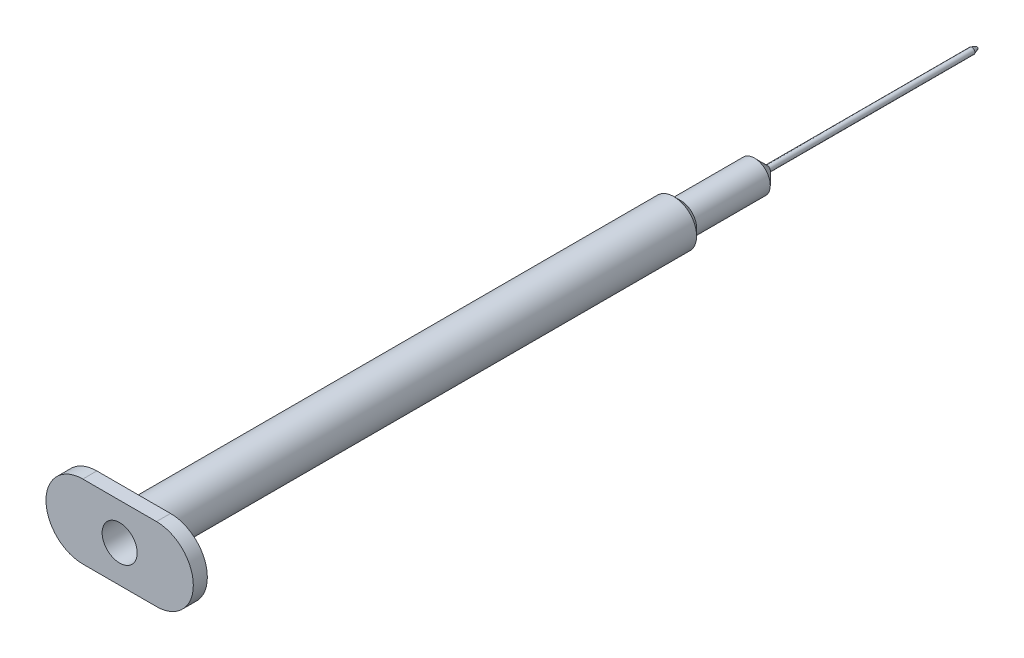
ISO-10303-21;
HEADER;
FILE_DESCRIPTION(('STEP AP214'),'2;1');
FILE_NAME('part.step','',(''),(''),'','','');
FILE_SCHEMA(('AUTOMOTIVE_DESIGN { 1 0 10303 214 1 1 1 1 }'));
ENDSEC;
DATA;
#1=APPLICATION_CONTEXT('core data for automotive mechanical design processes');
#2=APPLICATION_PROTOCOL_DEFINITION('international standard','automotive_design',2000,#1);
#3=PRODUCT_CONTEXT('',#1,'mechanical');
#4=PRODUCT('Part','Part','',(#3));
#5=PRODUCT_RELATED_PRODUCT_CATEGORY('part','',(#4));
#6=PRODUCT_DEFINITION_FORMATION('','',#4);
#7=PRODUCT_DEFINITION_CONTEXT('part definition',#1,'design');
#8=PRODUCT_DEFINITION('design','',#6,#7);
#9=PRODUCT_DEFINITION_SHAPE('','',#8);
#10=(LENGTH_UNIT() NAMED_UNIT(*) SI_UNIT(.MILLI.,.METRE.));
#11=(NAMED_UNIT(*) PLANE_ANGLE_UNIT() SI_UNIT($,.RADIAN.));
#12=(NAMED_UNIT(*) SI_UNIT($,.STERADIAN.) SOLID_ANGLE_UNIT());
#13=UNCERTAINTY_MEASURE_WITH_UNIT(LENGTH_MEASURE(1.E-05),#10,'distance_accuracy_value','');
#14=(GEOMETRIC_REPRESENTATION_CONTEXT(3) GLOBAL_UNCERTAINTY_ASSIGNED_CONTEXT((#13)) GLOBAL_UNIT_ASSIGNED_CONTEXT((#10,
#11,#12)) REPRESENTATION_CONTEXT('',''));
#15=CARTESIAN_POINT('',(0.,0.,0.));
#16=DIRECTION('',(0.,0.,1.));
#17=DIRECTION('',(1.,0.,0.));
#18=AXIS2_PLACEMENT_3D('',#15,#16,#17);
#19=CARTESIAN_POINT('',(0.,0.,-75.));
#20=DIRECTION('',(0.,0.,-1.));
#21=DIRECTION('',(-1.,0.,0.));
#22=AXIS2_PLACEMENT_3D('',#19,#20,#21);
#23=PLANE('',#22);
#24=CARTESIAN_POINT('',(0.,0.,-75.));
#25=DIRECTION('',(0.,0.,1.));
#26=DIRECTION('',(1.,0.,0.));
#27=AXIS2_PLACEMENT_3D('',#24,#25,#26);
#28=CIRCLE('',#27,2.5);
#29=CARTESIAN_POINT('',(2.5,0.,-75.));
#30=VERTEX_POINT('',#29);
#31=EDGE_CURVE('E115',#30,#30,#28,.T.);
#32=ORIENTED_EDGE('',*,*,#31,.T.);
#33=EDGE_LOOP('',(#32));
#34=FACE_BOUND('',#33,.T.);
#35=CARTESIAN_POINT('',(0.,0.,-75.));
#36=DIRECTION('',(0.,0.,-1.));
#37=DIRECTION('',(-1.,0.,0.));
#38=AXIS2_PLACEMENT_3D('',#35,#36,#37);
#39=CIRCLE('',#38,0.175);
#40=CARTESIAN_POINT('',(-0.175,0.,-75.));
#41=VERTEX_POINT('',#40);
#42=EDGE_CURVE('E207',#41,#41,#39,.F.);
#43=ORIENTED_EDGE('',*,*,#42,.F.);
#44=EDGE_LOOP('',(#43));
#45=FACE_BOUND('',#44,.T.);
#46=ADVANCED_FACE('F34',(#34,#45),#23,.F.);
#47=CARTESIAN_POINT('',(0.,0.,-75.));
#48=DIRECTION('',(0.,0.,1.));
#49=DIRECTION('',(1.,0.,0.));
#50=AXIS2_PLACEMENT_3D('',#47,#48,#49);
#51=CYLINDRICAL_SURFACE('',#50,2.5);
#52=CARTESIAN_POINT('',(0.,0.,2.));
#53=DIRECTION('',(0.,0.,1.));
#54=DIRECTION('',(1.,0.,0.));
#55=AXIS2_PLACEMENT_3D('',#52,#53,#54);
#56=CIRCLE('',#55,2.5);
#57=CARTESIAN_POINT('',(2.5,0.,2.));
#58=VERTEX_POINT('',#57);
#59=EDGE_CURVE('E105',#58,#58,#56,.T.);
#60=ORIENTED_EDGE('',*,*,#59,.T.);
#61=EDGE_LOOP('',(#60));
#62=FACE_BOUND('',#61,.T.);
#63=ORIENTED_EDGE('',*,*,#31,.F.);
#64=EDGE_LOOP('',(#63));
#65=FACE_BOUND('',#64,.T.);
#66=ADVANCED_FACE('F144',(#62,#65),#51,.F.);
#67=CARTESIAN_POINT('',(0.,0.,-75.));
#68=DIRECTION('',(0.,0.,1.));
#69=DIRECTION('',(1.,0.,0.));
#70=AXIS2_PLACEMENT_3D('',#67,#68,#69);
#71=CYLINDRICAL_SURFACE('',#70,3.25);
#72=CARTESIAN_POINT('',(0.,0.,-77.));
#73=DIRECTION('',(0.,0.,1.));
#74=DIRECTION('',(1.,0.,0.));
#75=AXIS2_PLACEMENT_3D('',#72,#73,#74);
#76=CIRCLE('',#75,3.25);
#77=CARTESIAN_POINT('',(3.25,0.,-77.));
#78=VERTEX_POINT('',#77);
#79=EDGE_CURVE('E127',#78,#78,#76,.T.);
#80=ORIENTED_EDGE('',*,*,#79,.T.);
#81=EDGE_LOOP('',(#80));
#82=FACE_BOUND('',#81,.T.);
#83=CARTESIAN_POINT('',(0.,0.,0.));
#84=DIRECTION('',(0.,0.,1.));
#85=DIRECTION('',(1.,0.,0.));
#86=AXIS2_PLACEMENT_3D('',#83,#84,#85);
#87=CIRCLE('',#86,3.25);
#88=CARTESIAN_POINT('',(3.25,0.,0.));
#89=VERTEX_POINT('',#88);
#90=EDGE_CURVE('E118',#89,#89,#87,.T.);
#91=ORIENTED_EDGE('',*,*,#90,.F.);
#92=EDGE_LOOP('',(#91));
#93=FACE_BOUND('',#92,.T.);
#94=ADVANCED_FACE('F150',(#82,#93),#71,.T.);
#95=CARTESIAN_POINT('',(0.,0.,-120.5));
#96=DIRECTION('',(0.,0.,-1.));
#97=DIRECTION('',(-1.,0.,0.));
#98=AXIS2_PLACEMENT_3D('',#95,#96,#97);
#99=CYLINDRICAL_SURFACE('',#98,2.25);
#100=CARTESIAN_POINT('',(0.,0.,-88.5));
#101=DIRECTION('',(0.,0.,1.));
#102=DIRECTION('',(1.,0.,0.));
#103=AXIS2_PLACEMENT_3D('',#100,#101,#102);
#104=CIRCLE('',#103,2.25);
#105=CARTESIAN_POINT('',(2.25,0.,-88.5));
#106=VERTEX_POINT('',#105);
#107=EDGE_CURVE('E121',#106,#106,#104,.T.);
#108=ORIENTED_EDGE('',*,*,#107,.T.);
#109=EDGE_LOOP('',(#108));
#110=FACE_BOUND('',#109,.T.);
#111=CARTESIAN_POINT('',(0.,0.,-78.));
#112=DIRECTION('',(0.,0.,-1.));
#113=DIRECTION('',(-1.,0.,0.));
#114=AXIS2_PLACEMENT_3D('',#111,#112,#113);
#115=CIRCLE('',#114,2.25);
#116=CARTESIAN_POINT('',(-2.25000000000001,0.,-78.));
#117=VERTEX_POINT('',#116);
#118=EDGE_CURVE('E112',#117,#117,#115,.T.);
#119=ORIENTED_EDGE('',*,*,#118,.T.);
#120=EDGE_LOOP('',(#119));
#121=FACE_BOUND('',#120,.T.);
#122=ADVANCED_FACE('F155',(#110,#121),#99,.T.);
#123=CARTESIAN_POINT('',(0.,0.,-120.5));
#124=DIRECTION('',(0.,0.,-1.));
#125=DIRECTION('',(-1.,0.,0.));
#126=AXIS2_PLACEMENT_3D('',#123,#124,#125);
#127=CYLINDRICAL_SURFACE('',#126,0.425000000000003);
#128=CARTESIAN_POINT('',(0.,0.,-119.5));
#129=DIRECTION('',(0.,0.,1.));
#130=DIRECTION('',(1.,0.,0.));
#131=AXIS2_PLACEMENT_3D('',#128,#129,#130);
#132=CIRCLE('',#131,0.425000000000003);
#133=CARTESIAN_POINT('',(0.425000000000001,0.,-119.5));
#134=VERTEX_POINT('',#133);
#135=EDGE_CURVE('E11',#134,#134,#132,.T.);
#136=ORIENTED_EDGE('',*,*,#135,.T.);
#137=EDGE_LOOP('',(#136));
#138=FACE_BOUND('',#137,.T.);
#139=CARTESIAN_POINT('',(0.,0.,-90.325));
#140=DIRECTION('',(0.,0.,1.));
#141=DIRECTION('',(1.,0.,0.));
#142=AXIS2_PLACEMENT_3D('',#139,#140,#141);
#143=CIRCLE('',#142,0.425000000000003);
#144=CARTESIAN_POINT('',(0.424999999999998,0.,-90.325));
#145=VERTEX_POINT('',#144);
#146=EDGE_CURVE('E124',#145,#145,#143,.F.);
#147=ORIENTED_EDGE('',*,*,#146,.T.);
#148=EDGE_LOOP('',(#147));
#149=FACE_BOUND('',#148,.T.);
#150=ADVANCED_FACE('F164',(#138,#149),#127,.T.);
#151=CARTESIAN_POINT('',(0.,0.,-90.5));
#152=DIRECTION('',(0.,0.,1.));
#153=DIRECTION('',(1.,0.,0.));
#154=AXIS2_PLACEMENT_3D('',#151,#152,#153);
#155=CONICAL_SURFACE('',#154,0.249999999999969,0.785398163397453);
#156=CARTESIAN_POINT('',(2.25,0.,-88.5));
#157=CARTESIAN_POINT('',(2.23098958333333,0.,-88.5190104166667));
#158=CARTESIAN_POINT('',(2.21197916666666,0.,-88.5380208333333));
#159=CARTESIAN_POINT('',(2.17395833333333,0.,-88.5760416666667));
#160=CARTESIAN_POINT('',(2.15494791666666,0.,-88.5950520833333));
#161=CARTESIAN_POINT('',(2.11692708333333,0.,-88.6330729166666));
#162=CARTESIAN_POINT('',(2.09791666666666,0.,-88.6520833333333));
#163=CARTESIAN_POINT('',(2.05989583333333,0.,-88.6901041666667));
#164=CARTESIAN_POINT('',(2.04088541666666,0.,-88.7091145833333));
#165=CARTESIAN_POINT('',(2.00286458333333,0.,-88.7471354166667));
#166=CARTESIAN_POINT('',(1.98385416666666,0.,-88.7661458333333));
#167=CARTESIAN_POINT('',(1.94583333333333,0.,-88.8041666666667));
#168=CARTESIAN_POINT('',(1.92682291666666,0.,-88.8231770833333));
#169=CARTESIAN_POINT('',(1.88880208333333,0.,-88.8611979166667));
#170=CARTESIAN_POINT('',(1.86979166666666,0.,-88.8802083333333));
#171=CARTESIAN_POINT('',(1.83177083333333,0.,-88.9182291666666));
#172=CARTESIAN_POINT('',(1.81276041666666,0.,-88.9372395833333));
#173=CARTESIAN_POINT('',(1.77473958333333,0.,-88.9752604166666));
#174=CARTESIAN_POINT('',(1.75572916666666,0.,-88.9942708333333));
#175=CARTESIAN_POINT('',(1.71770833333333,0.,-89.0322916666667));
#176=CARTESIAN_POINT('',(1.69869791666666,0.,-89.0513020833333));
#177=CARTESIAN_POINT('',(1.66067708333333,0.,-89.0893229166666));
#178=CARTESIAN_POINT('',(1.64166666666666,0.,-89.1083333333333));
#179=CARTESIAN_POINT('',(1.60364583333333,0.,-89.1463541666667));
#180=CARTESIAN_POINT('',(1.58463541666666,0.,-89.1653645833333));
#181=CARTESIAN_POINT('',(1.54661458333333,0.,-89.2033854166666));
#182=CARTESIAN_POINT('',(1.52760416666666,0.,-89.2223958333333));
#183=CARTESIAN_POINT('',(1.48958333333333,0.,-89.2604166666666));
#184=CARTESIAN_POINT('',(1.47057291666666,0.,-89.2794270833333));
#185=CARTESIAN_POINT('',(1.43255208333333,0.,-89.3174479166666));
#186=CARTESIAN_POINT('',(1.41354166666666,0.,-89.3364583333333));
#187=CARTESIAN_POINT('',(1.37552083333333,0.,-89.3744791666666));
#188=CARTESIAN_POINT('',(1.35651041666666,0.,-89.3934895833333));
#189=CARTESIAN_POINT('',(1.31848958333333,0.,-89.4315104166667));
#190=CARTESIAN_POINT('',(1.29947916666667,0.,-89.4505208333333));
#191=CARTESIAN_POINT('',(1.26145833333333,0.,-89.4885416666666));
#192=CARTESIAN_POINT('',(1.24244791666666,0.,-89.5075520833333));
#193=CARTESIAN_POINT('',(1.20442708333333,0.,-89.5455729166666));
#194=CARTESIAN_POINT('',(1.18541666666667,0.,-89.5645833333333));
#195=CARTESIAN_POINT('',(1.14739583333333,0.,-89.6026041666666));
#196=CARTESIAN_POINT('',(1.12838541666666,0.,-89.6216145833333));
#197=CARTESIAN_POINT('',(1.09036458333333,0.,-89.6596354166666));
#198=CARTESIAN_POINT('',(1.07135416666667,0.,-89.6786458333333));
#199=CARTESIAN_POINT('',(1.03333333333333,0.,-89.7166666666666));
#200=CARTESIAN_POINT('',(1.01432291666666,0.,-89.7356770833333));
#201=CARTESIAN_POINT('',(0.976302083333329,0.,-89.7736979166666));
#202=CARTESIAN_POINT('',(0.957291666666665,0.,-89.7927083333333));
#203=CARTESIAN_POINT('',(0.919270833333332,0.,-89.8307291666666));
#204=CARTESIAN_POINT('',(0.900260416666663,0.,-89.8497395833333));
#205=CARTESIAN_POINT('',(0.86223958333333,0.,-89.8877604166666));
#206=CARTESIAN_POINT('',(0.843229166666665,0.,-89.9067708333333));
#207=CARTESIAN_POINT('',(0.805208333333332,0.,-89.9447916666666));
#208=CARTESIAN_POINT('',(0.786197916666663,0.,-89.9638020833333));
#209=CARTESIAN_POINT('',(0.74817708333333,0.,-90.0018229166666));
#210=CARTESIAN_POINT('',(0.729166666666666,0.,-90.0208333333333));
#211=CARTESIAN_POINT('',(0.691145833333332,0.,-90.0588541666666));
#212=CARTESIAN_POINT('',(0.672135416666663,0.,-90.0778645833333));
#213=CARTESIAN_POINT('',(0.63411458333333,0.,-90.1158854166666));
#214=CARTESIAN_POINT('',(0.615104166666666,0.,-90.1348958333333));
#215=CARTESIAN_POINT('',(0.577083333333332,0.,-90.1729166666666));
#216=CARTESIAN_POINT('',(0.558072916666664,0.,-90.1919270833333));
#217=CARTESIAN_POINT('',(0.52005208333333,0.,-90.2299479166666));
#218=CARTESIAN_POINT('',(0.501041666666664,0.,-90.2489583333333));
#219=CARTESIAN_POINT('',(0.463020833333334,0.,-90.2869791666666));
#220=CARTESIAN_POINT('',(0.444010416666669,0.,-90.3059895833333));
#221=CARTESIAN_POINT('',(0.424999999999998,0.,-90.325));
#222=B_SPLINE_CURVE_WITH_KNOTS('',3,(#156,#157,#158,#159,#160,#161,#162,#163,#164,#165,#166,
#167,#168,#169,#170,#171,#172,#173,#174,#175,#176,#177,#178,#179,#180,#181,#182,#183,#184,#185,
#186,#187,#188,#189,#190,#191,#192,#193,#194,#195,#196,#197,#198,#199,#200,#201,#202,#203,#204,
#205,#206,#207,#208,#209,#210,#211,#212,#213,#214,#215,#216,#217,#218,#219,#220,#221),
.UNSPECIFIED.,.F.,.F.,(4,2,2,2,2,2,2,2,2,2,2,2,2,2,2,2,2,2,2,2,2,2,2,2,2,2,2,2,2,2,2,2,4),(0.,
0.0806543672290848,0.161308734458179,0.241963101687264,0.322617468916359,0.403271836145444,
0.483926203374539,0.564580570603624,0.645234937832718,0.725889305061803,0.806543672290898,
0.887198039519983,0.967852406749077,1.04850677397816,1.12916114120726,1.20981550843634,
1.29046987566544,1.37112424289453,1.45177861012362,1.53243297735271,1.6130873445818,
1.69374171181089,1.77439607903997,1.85505044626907,1.93570481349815,2.01635918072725,
2.09701354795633,2.17766791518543,2.25832228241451,2.33897664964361,2.41963101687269,
2.50028538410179,2.58093975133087),.UNSPECIFIED.);
#223=EDGE_CURVE('BSEAM161',#106,#145,#222,.T.);
#224=ORIENTED_EDGE('',*,*,#107,.F.);
#225=ORIENTED_EDGE('',*,*,#146,.F.);
#226=ORIENTED_EDGE('',*,*,#223,.T.);
#227=ORIENTED_EDGE('',*,*,#223,.F.);
#228=EDGE_LOOP('',(#224,#226,#225,#227));
#229=FACE_BOUND('',#228,.T.);
#230=ADVANCED_FACE('F161',(#229),#155,.T.);
#231=CARTESIAN_POINT('',(0.,0.,-78.));
#232=DIRECTION('',(0.,0.,1.));
#233=DIRECTION('',(1.,0.,0.));
#234=AXIS2_PLACEMENT_3D('',#231,#232,#233);
#235=CONICAL_SURFACE('',#234,2.24999999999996,0.785398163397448);
#236=ORIENTED_EDGE('',*,*,#79,.F.);
#237=EDGE_LOOP('',(#236));
#238=FACE_BOUND('',#237,.T.);
#239=ORIENTED_EDGE('',*,*,#118,.F.);
#240=EDGE_LOOP('',(#239));
#241=FACE_BOUND('',#240,.T.);
#242=ADVANCED_FACE('F163',(#238,#241),#235,.T.);
#243=CARTESIAN_POINT('',(-5.25,0.,2.));
#244=DIRECTION('',(0.,0.,-1.));
#245=DIRECTION('',(-1.,0.,0.));
#246=AXIS2_PLACEMENT_3D('',#243,#244,#245);
#247=CYLINDRICAL_SURFACE('',#246,5.25);
#248=CARTESIAN_POINT('',(-5.25,0.,0.));
#249=DIRECTION('',(0.,0.,1.));
#250=DIRECTION('',(1.,0.,0.));
#251=AXIS2_PLACEMENT_3D('',#248,#249,#250);
#252=CIRCLE('',#251,5.25);
#253=CARTESIAN_POINT('',(-5.25,5.25,0.));
#254=VERTEX_POINT('',#253);
#255=CARTESIAN_POINT('',(-5.25,-5.25,0.));
#256=VERTEX_POINT('',#255);
#257=EDGE_CURVE('E102',#254,#256,#252,.T.);
#258=ORIENTED_EDGE('',*,*,#257,.T.);
#259=DIRECTION('',(0.,0.,-1.));
#260=VECTOR('',#259,1.);
#261=CARTESIAN_POINT('',(-5.25,-5.25,2.));
#262=LINE('',#261,#260);
#263=CARTESIAN_POINT('',(-5.25,-5.25,2.));
#264=VERTEX_POINT('',#263);
#265=EDGE_CURVE('E93',#264,#256,#262,.T.);
#266=ORIENTED_EDGE('',*,*,#265,.F.);
#267=CARTESIAN_POINT('',(-5.25,0.,2.));
#268=DIRECTION('',(0.,0.,1.));
#269=DIRECTION('',(1.,0.,0.));
#270=AXIS2_PLACEMENT_3D('',#267,#268,#269);
#271=CIRCLE('',#270,5.25);
#272=CARTESIAN_POINT('',(-5.25,5.25,2.));
#273=VERTEX_POINT('',#272);
#274=EDGE_CURVE('E87',#273,#264,#271,.T.);
#275=ORIENTED_EDGE('',*,*,#274,.F.);
#276=DIRECTION('',(0.,0.,-1.));
#277=VECTOR('',#276,1.);
#278=CARTESIAN_POINT('',(-5.25,5.25,2.));
#279=LINE('',#278,#277);
#280=EDGE_CURVE('E98',#273,#254,#279,.T.);
#281=ORIENTED_EDGE('',*,*,#280,.T.);
#282=EDGE_LOOP('',(#258,#266,#275,#281));
#283=FACE_BOUND('',#282,.T.);
#284=ADVANCED_FACE('F167',(#283),#247,.T.);
#285=CARTESIAN_POINT('',(-5.25,-5.25,2.));
#286=DIRECTION('',(0.,1.,0.));
#287=DIRECTION('',(0.,0.,1.));
#288=AXIS2_PLACEMENT_3D('',#285,#286,#287);
#289=PLANE('',#288);
#290=DIRECTION('',(1.,0.,0.));
#291=VECTOR('',#290,1.);
#292=CARTESIAN_POINT('',(-5.25,-5.25,0.));
#293=LINE('',#292,#291);
#294=CARTESIAN_POINT('',(5.25,-5.25,0.));
#295=VERTEX_POINT('',#294);
#296=EDGE_CURVE('E92',#256,#295,#293,.T.);
#297=ORIENTED_EDGE('',*,*,#296,.T.);
#298=DIRECTION('',(0.,0.,-1.));
#299=VECTOR('',#298,1.);
#300=CARTESIAN_POINT('',(5.25,-5.25,2.));
#301=LINE('',#300,#299);
#302=CARTESIAN_POINT('',(5.25,-5.25,2.));
#303=VERTEX_POINT('',#302);
#304=EDGE_CURVE('E90',#303,#295,#301,.T.);
#305=ORIENTED_EDGE('',*,*,#304,.F.);
#306=DIRECTION('',(1.,0.,0.));
#307=VECTOR('',#306,1.);
#308=CARTESIAN_POINT('',(-5.25,-5.25,2.));
#309=LINE('',#308,#307);
#310=EDGE_CURVE('E82',#264,#303,#309,.T.);
#311=ORIENTED_EDGE('',*,*,#310,.F.);
#312=ORIENTED_EDGE('',*,*,#265,.T.);
#313=EDGE_LOOP('',(#297,#305,#311,#312));
#314=FACE_BOUND('',#313,.T.);
#315=ADVANCED_FACE('F91',(#314),#289,.F.);
#316=CARTESIAN_POINT('',(5.25,0.,2.));
#317=DIRECTION('',(0.,0.,-1.));
#318=DIRECTION('',(-1.,0.,0.));
#319=AXIS2_PLACEMENT_3D('',#316,#317,#318);
#320=CYLINDRICAL_SURFACE('',#319,5.25);
#321=CARTESIAN_POINT('',(5.25,0.,0.));
#322=DIRECTION('',(0.,0.,1.));
#323=DIRECTION('',(1.,0.,0.));
#324=AXIS2_PLACEMENT_3D('',#321,#322,#323);
#325=CIRCLE('',#324,5.25);
#326=CARTESIAN_POINT('',(5.25,5.25,0.));
#327=VERTEX_POINT('',#326);
#328=EDGE_CURVE('E68',#295,#327,#325,.T.);
#329=ORIENTED_EDGE('',*,*,#328,.T.);
#330=DIRECTION('',(0.,0.,-1.));
#331=VECTOR('',#330,1.);
#332=CARTESIAN_POINT('',(5.25,5.25,2.));
#333=LINE('',#332,#331);
#334=CARTESIAN_POINT('',(5.25,5.25,2.));
#335=VERTEX_POINT('',#334);
#336=EDGE_CURVE('E94',#335,#327,#333,.T.);
#337=ORIENTED_EDGE('',*,*,#336,.F.);
#338=CARTESIAN_POINT('',(5.25,0.,2.));
#339=DIRECTION('',(0.,0.,1.));
#340=DIRECTION('',(1.,0.,0.));
#341=AXIS2_PLACEMENT_3D('',#338,#339,#340);
#342=CIRCLE('',#341,5.25);
#343=EDGE_CURVE('E85',#303,#335,#342,.T.);
#344=ORIENTED_EDGE('',*,*,#343,.F.);
#345=ORIENTED_EDGE('',*,*,#304,.T.);
#346=EDGE_LOOP('',(#329,#337,#344,#345));
#347=FACE_BOUND('',#346,.T.);
#348=ADVANCED_FACE('F96',(#347),#320,.T.);
#349=CARTESIAN_POINT('',(-5.25,5.25,2.));
#350=DIRECTION('',(0.,-1.,0.));
#351=DIRECTION('',(0.,0.,-1.));
#352=AXIS2_PLACEMENT_3D('',#349,#350,#351);
#353=PLANE('',#352);
#354=DIRECTION('',(-1.,0.,0.));
#355=VECTOR('',#354,1.);
#356=CARTESIAN_POINT('',(-5.25,5.25,0.));
#357=LINE('',#356,#355);
#358=EDGE_CURVE('E74',#327,#254,#357,.T.);
#359=ORIENTED_EDGE('',*,*,#358,.T.);
#360=ORIENTED_EDGE('',*,*,#280,.F.);
#361=DIRECTION('',(-1.,0.,0.));
#362=VECTOR('',#361,1.);
#363=CARTESIAN_POINT('',(-5.25,5.25,2.));
#364=LINE('',#363,#362);
#365=EDGE_CURVE('E51',#335,#273,#364,.T.);
#366=ORIENTED_EDGE('',*,*,#365,.F.);
#367=ORIENTED_EDGE('',*,*,#336,.T.);
#368=EDGE_LOOP('',(#359,#360,#366,#367));
#369=FACE_BOUND('',#368,.T.);
#370=ADVANCED_FACE('F195',(#369),#353,.F.);
#371=CARTESIAN_POINT('',(-5.25,0.,2.));
#372=DIRECTION('',(0.,0.,1.));
#373=DIRECTION('',(1.,0.,0.));
#374=AXIS2_PLACEMENT_3D('',#371,#372,#373);
#375=PLANE('',#374);
#376=ORIENTED_EDGE('',*,*,#59,.F.);
#377=EDGE_LOOP('',(#376));
#378=FACE_BOUND('',#377,.T.);
#379=ORIENTED_EDGE('',*,*,#274,.T.);
#380=ORIENTED_EDGE('',*,*,#310,.T.);
#381=ORIENTED_EDGE('',*,*,#343,.T.);
#382=ORIENTED_EDGE('',*,*,#365,.T.);
#383=EDGE_LOOP('',(#379,#380,#381,#382));
#384=FACE_BOUND('',#383,.T.);
#385=ADVANCED_FACE('F83',(#378,#384),#375,.T.);
#386=CARTESIAN_POINT('',(-5.25,0.,0.));
#387=DIRECTION('',(0.,0.,1.));
#388=DIRECTION('',(1.,0.,0.));
#389=AXIS2_PLACEMENT_3D('',#386,#387,#388);
#390=PLANE('',#389);
#391=ORIENTED_EDGE('',*,*,#90,.T.);
#392=EDGE_LOOP('',(#391));
#393=FACE_BOUND('',#392,.T.);
#394=ORIENTED_EDGE('',*,*,#257,.F.);
#395=ORIENTED_EDGE('',*,*,#358,.F.);
#396=ORIENTED_EDGE('',*,*,#328,.F.);
#397=ORIENTED_EDGE('',*,*,#296,.F.);
#398=EDGE_LOOP('',(#394,#395,#396,#397));
#399=FACE_BOUND('',#398,.T.);
#400=ADVANCED_FACE('F140',(#393,#399),#390,.F.);
#401=CARTESIAN_POINT('',(0.,0.,-120.5));
#402=DIRECTION('',(0.,0.,1.));
#403=DIRECTION('',(1.,0.,0.));
#404=AXIS2_PLACEMENT_3D('',#401,#402,#403);
#405=CYLINDRICAL_SURFACE('',#404,0.175);
#406=CARTESIAN_POINT('',(0.,0.,-120.186869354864));
#407=DIRECTION('',(0.,0.,1.));
#408=DIRECTION('',(1.,0.,0.));
#409=AXIS2_PLACEMENT_3D('',#406,#407,#408);
#410=CIRCLE('',#409,0.175);
#411=CARTESIAN_POINT('',(0.174999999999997,0.,-120.186869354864));
#412=VERTEX_POINT('',#411);
#413=EDGE_CURVE('E43',#412,#412,#410,.F.);
#414=ORIENTED_EDGE('',*,*,#413,.T.);
#415=EDGE_LOOP('',(#414));
#416=FACE_BOUND('',#415,.T.);
#417=ORIENTED_EDGE('',*,*,#42,.T.);
#418=EDGE_LOOP('',(#417));
#419=FACE_BOUND('',#418,.T.);
#420=ADVANCED_FACE('F132',(#416,#419),#405,.F.);
#421=CARTESIAN_POINT('',(0.,0.,-120.5));
#422=DIRECTION('',(0.,0.,1.));
#423=DIRECTION('',(1.,0.,0.));
#424=AXIS2_PLACEMENT_3D('',#421,#422,#423);
#425=CONICAL_SURFACE('',#424,0.0610297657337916,0.349065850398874);
#426=ORIENTED_EDGE('',*,*,#135,.F.);
#427=EDGE_LOOP('',(#426));
#428=FACE_BOUND('',#427,.T.);
#429=ORIENTED_EDGE('',*,*,#413,.F.);
#430=EDGE_LOOP('',(#429));
#431=FACE_BOUND('',#430,.T.);
#432=ADVANCED_FACE('F36',(#428,#431),#425,.T.);
#433=CLOSED_SHELL('',(#46,#66,#94,#122,#150,#230,#242,#284,#315,#348,#370,#385,#400,#420,#432));
#434=MANIFOLD_SOLID_BREP('B2',#433);
#435=ADVANCED_BREP_SHAPE_REPRESENTATION('',(#18,#434),#14);
#436=SHAPE_DEFINITION_REPRESENTATION(#9,#435);
ENDSEC;
END-ISO-10303-21;
